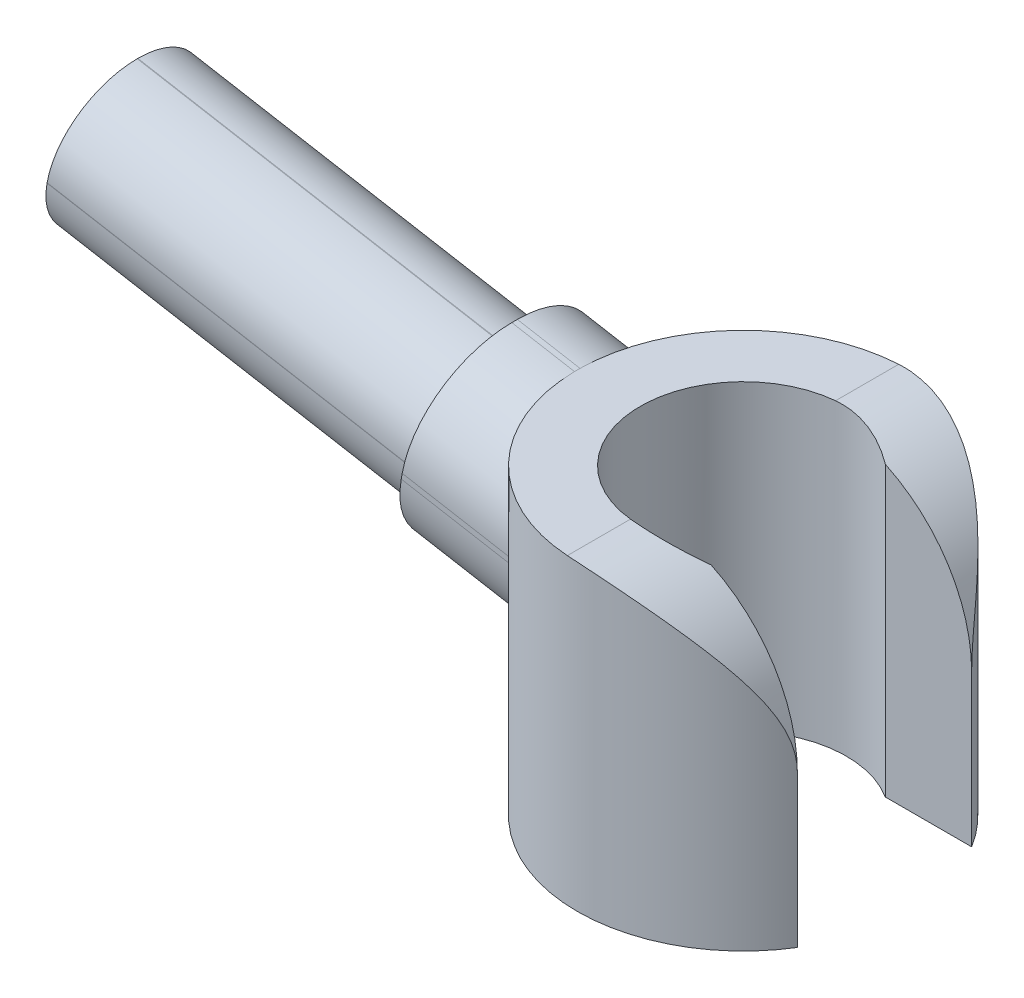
ISO-10303-21;
HEADER;
FILE_DESCRIPTION(('STEP AP214'),'2;1');
FILE_NAME('part.step','',(''),(''),'','','');
FILE_SCHEMA(('AUTOMOTIVE_DESIGN { 1 0 10303 214 1 1 1 1 }'));
ENDSEC;
DATA;
#1=APPLICATION_CONTEXT('core data for automotive mechanical design processes');
#2=APPLICATION_PROTOCOL_DEFINITION('international standard','automotive_design',2000,#1);
#3=PRODUCT_CONTEXT('',#1,'mechanical');
#4=PRODUCT('Part','Part','',(#3));
#5=PRODUCT_RELATED_PRODUCT_CATEGORY('part','',(#4));
#6=PRODUCT_DEFINITION_FORMATION('','',#4);
#7=PRODUCT_DEFINITION_CONTEXT('part definition',#1,'design');
#8=PRODUCT_DEFINITION('design','',#6,#7);
#9=PRODUCT_DEFINITION_SHAPE('','',#8);
#10=(LENGTH_UNIT() NAMED_UNIT(*) SI_UNIT(.MILLI.,.METRE.));
#11=(NAMED_UNIT(*) PLANE_ANGLE_UNIT() SI_UNIT($,.RADIAN.));
#12=(NAMED_UNIT(*) SI_UNIT($,.STERADIAN.) SOLID_ANGLE_UNIT());
#13=UNCERTAINTY_MEASURE_WITH_UNIT(LENGTH_MEASURE(1.E-05),#10,'distance_accuracy_value','');
#14=(GEOMETRIC_REPRESENTATION_CONTEXT(3) GLOBAL_UNCERTAINTY_ASSIGNED_CONTEXT((#13)) GLOBAL_UNIT_ASSIGNED_CONTEXT((#10,
#11,#12)) REPRESENTATION_CONTEXT('',''));
#15=CARTESIAN_POINT('',(0.,0.,0.));
#16=DIRECTION('',(0.,0.,1.));
#17=DIRECTION('',(1.,0.,0.));
#18=AXIS2_PLACEMENT_3D('',#15,#16,#17);
#19=CARTESIAN_POINT('',(-6.55577603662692,1.80583322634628,-0.01));
#20=DIRECTION('',(0.984807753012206,-0.173648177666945,0.));
#21=DIRECTION('',(0.173648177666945,0.984807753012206,0.));
#22=AXIS2_PLACEMENT_3D('',#19,#20,#21);
#23=CYLINDRICAL_SURFACE('',#22,1.1);
#24=DIRECTION('',(0.984807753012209,-0.173648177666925,0.));
#25=VECTOR('',#24,1.);
#26=CARTESIAN_POINT('',(-4.1233945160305,0.259969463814,-0.00999999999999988));
#27=LINE('',#26,#25);
#28=CARTESIAN_POINT('',(-6.74678903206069,0.722544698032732,-0.00999999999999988));
#29=VERTEX_POINT('',#28);
#30=CARTESIAN_POINT('',(-1.50000000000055,-0.20260577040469,-0.00999999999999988));
#31=VERTEX_POINT('',#30);
#32=EDGE_CURVE('E208',#29,#31,#27,.T.);
#33=ORIENTED_EDGE('',*,*,#32,.F.);
#34=CARTESIAN_POINT('',(-6.55577603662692,1.80583322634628,-0.01));
#35=DIRECTION('',(0.984807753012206,-0.173648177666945,0.));
#36=DIRECTION('',(0.173648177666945,0.984807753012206,0.));
#37=AXIS2_PLACEMENT_3D('',#34,#35,#36);
#38=CIRCLE('',#37,1.1);
#39=CARTESIAN_POINT('',(-6.55577603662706,1.80583322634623,-1.11));
#40=VERTEX_POINT('',#39);
#41=EDGE_CURVE('E204',#40,#29,#38,.F.);
#42=ORIENTED_EDGE('',*,*,#41,.F.);
#43=DIRECTION('',(0.984807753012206,-0.173648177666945,0.));
#44=VECTOR('',#43,1.);
#45=CARTESIAN_POINT('',(-6.55577603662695,1.80583322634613,-1.11));
#46=LINE('',#45,#44);
#47=CARTESIAN_POINT('',(-1.16940035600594,0.856069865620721,-1.11));
#48=VERTEX_POINT('',#47);
#49=EDGE_CURVE('E202',#40,#48,#46,.T.);
#50=ORIENTED_EDGE('',*,*,#49,.T.);
#51=CARTESIAN_POINT('',(-1.16940035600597,0.856069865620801,-0.01));
#52=DIRECTION('',(0.984807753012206,-0.173648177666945,0.));
#53=DIRECTION('',(0.173648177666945,0.984807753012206,0.));
#54=AXIS2_PLACEMENT_3D('',#51,#52,#53);
#55=CIRCLE('',#54,1.1);
#56=CARTESIAN_POINT('',(-1.35561396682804,-0.2,-0.255032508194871));
#57=VERTEX_POINT('',#56);
#58=EDGE_CURVE('E190',#57,#48,#55,.T.);
#59=ORIENTED_EDGE('',*,*,#58,.F.);
#60=CARTESIAN_POINT('',(4.81986947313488,-0.2,-0.01));
#61=DIRECTION('',(0.,1.,0.));
#62=DIRECTION('',(1.,0.,0.));
#63=AXIS2_PLACEMENT_3D('',#60,#61,#62);
#64=ELLIPSE('',#63,6.33464753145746,1.1);
#65=CARTESIAN_POINT('',(-1.5,-0.2,-0.0850933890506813));
#66=VERTEX_POINT('',#65);
#67=EDGE_CURVE('E20',#66,#57,#64,.F.);
#68=ORIENTED_EDGE('',*,*,#67,.F.);
#69=CARTESIAN_POINT('',(-1.5,0.914363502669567,-0.01));
#70=DIRECTION('',(-1.,0.,0.));
#71=DIRECTION('',(0.,-1.,0.));
#72=AXIS2_PLACEMENT_3D('',#69,#70,#71);
#73=ELLIPSE('',#72,1.11696927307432,1.1);
#74=EDGE_CURVE('E176',#31,#66,#73,.F.);
#75=ORIENTED_EDGE('',*,*,#74,.F.);
#76=EDGE_LOOP('',(#33,#42,#50,#59,#68,#75));
#77=FACE_BOUND('',#76,.T.);
#78=ADVANCED_FACE('F16',(#77),#23,.T.);
#79=CARTESIAN_POINT('',(-6.851724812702,0.7410477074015,-0.0104));
#80=DIRECTION('',(-0.173648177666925,-0.984807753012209,0.));
#81=DIRECTION('',(0.984807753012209,-0.173648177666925,0.));
#82=AXIS2_PLACEMENT_3D('',#79,#80,#81);
#83=PLANE('',#82);
#84=DIRECTION('',(-0.984807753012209,0.173648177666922,0.));
#85=VECTOR('',#84,1.);
#86=CARTESIAN_POINT('',(-4.05360119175,0.2476630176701,0.01));
#87=LINE('',#86,#85);
#88=CARTESIAN_POINT('',(-1.50000000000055,-0.202605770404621,0.01));
#89=VERTEX_POINT('',#88);
#90=CARTESIAN_POINT('',(-6.7467890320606,0.722544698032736,0.01));
#91=VERTEX_POINT('',#90);
#92=EDGE_CURVE('E219',#89,#91,#87,.T.);
#93=ORIENTED_EDGE('',*,*,#92,.T.);
#94=DIRECTION('',(0.,0.,-1.));
#95=VECTOR('',#94,1.);
#96=CARTESIAN_POINT('',(-6.74678903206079,0.72254469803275,0.));
#97=LINE('',#96,#95);
#98=EDGE_CURVE('E211',#91,#29,#97,.T.);
#99=ORIENTED_EDGE('',*,*,#98,.T.);
#100=ORIENTED_EDGE('',*,*,#32,.T.);
#101=DIRECTION('',(0.,0.,1.));
#102=VECTOR('',#101,1.);
#103=CARTESIAN_POINT('',(-1.5000000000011,-0.202605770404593,0.));
#104=LINE('',#103,#102);
#105=EDGE_CURVE('E526',#31,#89,#104,.T.);
#106=ORIENTED_EDGE('',*,*,#105,.T.);
#107=EDGE_LOOP('',(#93,#99,#100,#106));
#108=FACE_BOUND('',#107,.T.);
#109=ADVANCED_FACE('F295',(#108),#83,.T.);
#110=CARTESIAN_POINT('',(-6.663561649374,0.83674510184,-1.11));
#111=DIRECTION('',(0.,0.,1.));
#112=DIRECTION('',(1.,0.,0.));
#113=AXIS2_PLACEMENT_3D('',#110,#111,#112);
#114=PLANE('',#113);
#115=ORIENTED_EDGE('',*,*,#49,.F.);
#116=DIRECTION('',(-0.173648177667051,-0.984807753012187,0.));
#117=VECTOR('',#116,1.);
#118=CARTESIAN_POINT('',(-6.354159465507,2.949257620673,-1.11));
#119=LINE('',#118,#117);
#120=CARTESIAN_POINT('',(-6.55287107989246,1.82230805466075,-1.11000000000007));
#121=VERTEX_POINT('',#120);
#122=EDGE_CURVE('E209',#121,#40,#119,.T.);
#123=ORIENTED_EDGE('',*,*,#122,.F.);
#124=DIRECTION('',(0.984807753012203,-0.173648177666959,0.));
#125=VECTOR('',#124,1.);
#126=CARTESIAN_POINT('',(-3.85968323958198,1.34742637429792,-1.11000000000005));
#127=LINE('',#126,#125);
#128=CARTESIAN_POINT('',(-1.16649539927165,0.87254469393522,-1.10999999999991));
#129=VERTEX_POINT('',#128);
#130=EDGE_CURVE('E224',#121,#129,#127,.T.);
#131=ORIENTED_EDGE('',*,*,#130,.T.);
#132=DIRECTION('',(-0.173648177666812,-0.984807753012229,0.));
#133=VECTOR('',#132,1.);
#134=CARTESIAN_POINT('',(-0.8970313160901,2.400751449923,-1.11));
#135=LINE('',#134,#133);
#136=EDGE_CURVE('E213',#48,#129,#135,.F.);
#137=ORIENTED_EDGE('',*,*,#136,.F.);
#138=EDGE_LOOP('',(#115,#123,#131,#137));
#139=FACE_BOUND('',#138,.T.);
#140=ADVANCED_FACE('F298',(#139),#114,.F.);
#141=CARTESIAN_POINT('',(-1.16940035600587,0.85606986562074,0.01));
#142=DIRECTION('',(-0.984807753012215,0.17364817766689,0.));
#143=DIRECTION('',(-0.17364817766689,-0.984807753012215,0.));
#144=AXIS2_PLACEMENT_3D('',#141,#142,#143);
#145=CYLINDRICAL_SURFACE('',#144,1.0999999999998);
#146=DIRECTION('',(0.984807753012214,-0.173648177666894,0.));
#147=VECTOR('',#146,1.);
#148=CARTESIAN_POINT('',(-6.555776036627,1.805833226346,1.11));
#149=LINE('',#148,#147);
#150=CARTESIAN_POINT('',(-6.55577603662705,1.80583322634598,1.11));
#151=VERTEX_POINT('',#150);
#152=CARTESIAN_POINT('',(-1.16940035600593,0.85606986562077,1.11));
#153=VERTEX_POINT('',#152);
#154=EDGE_CURVE('E227',#151,#153,#149,.T.);
#155=ORIENTED_EDGE('',*,*,#154,.F.);
#156=CARTESIAN_POINT('',(-6.55577603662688,1.80583322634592,0.00999999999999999));
#157=DIRECTION('',(-0.984807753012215,0.17364817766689,0.));
#158=DIRECTION('',(-0.17364817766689,-0.984807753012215,0.));
#159=AXIS2_PLACEMENT_3D('',#156,#157,#158);
#160=CIRCLE('',#159,1.0999999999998);
#161=EDGE_CURVE('E220',#91,#151,#160,.T.);
#162=ORIENTED_EDGE('',*,*,#161,.F.);
#163=ORIENTED_EDGE('',*,*,#92,.F.);
#164=CARTESIAN_POINT('',(-1.5,0.914363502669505,0.01));
#165=DIRECTION('',(-1.,0.,0.));
#166=DIRECTION('',(0.,1.,0.));
#167=AXIS2_PLACEMENT_3D('',#164,#165,#166);
#168=ELLIPSE('',#167,1.11696927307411,1.0999999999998);
#169=CARTESIAN_POINT('',(-1.5,-0.2,0.0850933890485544));
#170=VERTEX_POINT('',#169);
#171=EDGE_CURVE('E217',#170,#89,#168,.F.);
#172=ORIENTED_EDGE('',*,*,#171,.F.);
#173=CARTESIAN_POINT('',(4.81986947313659,-0.2,0.01));
#174=DIRECTION('',(0.,1.,0.));
#175=DIRECTION('',(-1.,0.,0.));
#176=AXIS2_PLACEMENT_3D('',#173,#174,#175);
#177=ELLIPSE('',#176,6.33464753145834,1.0999999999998);
#178=CARTESIAN_POINT('',(-1.35561396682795,-0.2,0.255032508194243));
#179=VERTEX_POINT('',#178);
#180=EDGE_CURVE('E215',#179,#170,#177,.F.);
#181=ORIENTED_EDGE('',*,*,#180,.F.);
#182=CARTESIAN_POINT('',(-1.16940035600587,0.85606986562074,0.01));
#183=DIRECTION('',(-0.984807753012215,0.17364817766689,0.));
#184=DIRECTION('',(-0.17364817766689,-0.984807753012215,0.));
#185=AXIS2_PLACEMENT_3D('',#182,#183,#184);
#186=CIRCLE('',#185,1.0999999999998);
#187=EDGE_CURVE('E222',#153,#179,#186,.F.);
#188=ORIENTED_EDGE('',*,*,#187,.F.);
#189=EDGE_LOOP('',(#155,#162,#163,#172,#181,#188));
#190=FACE_BOUND('',#189,.T.);
#191=ADVANCED_FACE('F302',(#190),#145,.T.);
#192=CARTESIAN_POINT('',(-1.16649539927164,0.872544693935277,-0.01));
#193=DIRECTION('',(-0.984807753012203,0.173648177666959,0.));
#194=DIRECTION('',(-0.173648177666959,-0.984807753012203,0.));
#195=AXIS2_PLACEMENT_3D('',#192,#193,#194);
#196=CYLINDRICAL_SURFACE('',#195,1.10000000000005);
#197=DIRECTION('',(-0.984807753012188,0.173648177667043,0.));
#198=VECTOR('',#197,1.);
#199=CARTESIAN_POINT('',(-3.6686702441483,2.4307149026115,-0.0099999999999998));
#200=LINE('',#199,#198);
#201=CARTESIAN_POINT('',(-0.975482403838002,1.95583322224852,-0.0099999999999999));
#202=VERTEX_POINT('',#201);
#203=CARTESIAN_POINT('',(-6.36185808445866,2.90559658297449,-0.01));
#204=VERTEX_POINT('',#203);
#205=EDGE_CURVE('E563',#202,#204,#200,.T.);
#206=ORIENTED_EDGE('',*,*,#205,.F.);
#207=CARTESIAN_POINT('',(-1.16649539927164,0.872544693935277,-0.01));
#208=DIRECTION('',(-0.984807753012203,0.173648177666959,0.));
#209=DIRECTION('',(-0.173648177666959,-0.984807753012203,0.));
#210=AXIS2_PLACEMENT_3D('',#207,#208,#209);
#211=CIRCLE('',#210,1.10000000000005);
#212=EDGE_CURVE('E225',#129,#202,#211,.F.);
#213=ORIENTED_EDGE('',*,*,#212,.F.);
#214=ORIENTED_EDGE('',*,*,#130,.F.);
#215=CARTESIAN_POINT('',(-6.55287107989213,1.82230805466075,-0.0100000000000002));
#216=DIRECTION('',(-0.984807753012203,0.173648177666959,0.));
#217=DIRECTION('',(-0.173648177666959,-0.984807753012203,0.));
#218=AXIS2_PLACEMENT_3D('',#215,#216,#217);
#219=CIRCLE('',#218,1.10000000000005);
#220=EDGE_CURVE('E233',#204,#121,#219,.T.);
#221=ORIENTED_EDGE('',*,*,#220,.F.);
#222=EDGE_LOOP('',(#206,#213,#214,#221));
#223=FACE_BOUND('',#222,.T.);
#224=ADVANCED_FACE('F308',(#223),#196,.T.);
#225=CARTESIAN_POINT('',(-6.663526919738,0.8369420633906,1.11));
#226=DIRECTION('',(0.,0.,1.));
#227=DIRECTION('',(1.,0.,0.));
#228=AXIS2_PLACEMENT_3D('',#225,#226,#227);
#229=PLANE('',#228);
#230=ORIENTED_EDGE('',*,*,#154,.T.);
#231=DIRECTION('',(0.173648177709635,0.984807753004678,0.));
#232=VECTOR('',#231,1.);
#233=CARTESIAN_POINT('',(-1.169400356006,0.8560698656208,1.11));
#234=LINE('',#233,#232);
#235=CARTESIAN_POINT('',(-1.16823188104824,0.862696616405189,1.10999999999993));
#236=VERTEX_POINT('',#235);
#237=EDGE_CURVE('E230',#153,#236,#234,.T.);
#238=ORIENTED_EDGE('',*,*,#237,.T.);
#239=DIRECTION('',(-0.984807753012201,0.17364817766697,0.));
#240=VECTOR('',#239,1.);
#241=CARTESIAN_POINT('',(-3.86141972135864,1.33757829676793,1.10999999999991));
#242=LINE('',#241,#240);
#243=CARTESIAN_POINT('',(-6.55460756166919,1.81245997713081,1.11000000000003));
#244=VERTEX_POINT('',#243);
#245=EDGE_CURVE('E240',#236,#244,#242,.T.);
#246=ORIENTED_EDGE('',*,*,#245,.T.);
#247=DIRECTION('',(0.173648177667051,0.984807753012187,0.));
#248=VECTOR('',#247,1.);
#249=CARTESIAN_POINT('',(-6.55432355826,1.81407064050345,1.11));
#250=LINE('',#249,#248);
#251=EDGE_CURVE('E232',#151,#244,#250,.T.);
#252=ORIENTED_EDGE('',*,*,#251,.F.);
#253=EDGE_LOOP('',(#230,#238,#246,#252));
#254=FACE_BOUND('',#253,.T.);
#255=ADVANCED_FACE('F304',(#254),#229,.T.);
#256=CARTESIAN_POINT('',(-6.354159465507,2.949257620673,-1.1544));
#257=DIRECTION('',(-0.984807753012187,0.173648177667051,0.));
#258=DIRECTION('',(-0.173648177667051,-0.984807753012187,0.));
#259=AXIS2_PLACEMENT_3D('',#256,#257,#258);
#260=PLANE('',#259);
#261=DIRECTION('',(0.,0.,1.));
#262=VECTOR('',#261,1.);
#263=CARTESIAN_POINT('',(-6.36185808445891,2.90559658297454,-0.00499999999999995));
#264=LINE('',#263,#262);
#265=CARTESIAN_POINT('',(-6.36185808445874,2.90559658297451,0.));
#266=VERTEX_POINT('',#265);
#267=EDGE_CURVE('E561',#204,#266,#264,.T.);
#268=ORIENTED_EDGE('',*,*,#267,.F.);
#269=ORIENTED_EDGE('',*,*,#220,.T.);
#270=ORIENTED_EDGE('',*,*,#122,.T.);
#271=ORIENTED_EDGE('',*,*,#41,.T.);
#272=ORIENTED_EDGE('',*,*,#98,.F.);
#273=ORIENTED_EDGE('',*,*,#161,.T.);
#274=ORIENTED_EDGE('',*,*,#251,.T.);
#275=CARTESIAN_POINT('',(-6.55460756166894,1.81245997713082,0.));
#276=DIRECTION('',(0.984807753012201,-0.17364817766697,0.));
#277=DIRECTION('',(0.17364817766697,0.984807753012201,0.));
#278=AXIS2_PLACEMENT_3D('',#275,#276,#277);
#279=CIRCLE('',#278,1.10999999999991);
#280=EDGE_CURVE('E237',#244,#266,#279,.F.);
#281=ORIENTED_EDGE('',*,*,#280,.T.);
#282=EDGE_LOOP('',(#268,#269,#270,#271,#272,#273,#274,#281));
#283=FACE_BOUND('',#282,.T.);
#284=ADVANCED_FACE('F307',(#283),#260,.T.);
#285=CARTESIAN_POINT('',(-0.8677548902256,1.936837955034,-0.0102));
#286=DIRECTION('',(0.173648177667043,0.984807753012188,0.));
#287=DIRECTION('',(-0.984807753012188,0.173648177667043,0.));
#288=AXIS2_PLACEMENT_3D('',#285,#286,#287);
#289=PLANE('',#288);
#290=ORIENTED_EDGE('',*,*,#205,.T.);
#291=ORIENTED_EDGE('',*,*,#267,.T.);
#292=DIRECTION('',(0.984807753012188,-0.173648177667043,0.));
#293=VECTOR('',#292,1.);
#294=CARTESIAN_POINT('',(-3.6686702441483,2.4307149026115,0.));
#295=LINE('',#294,#293);
#296=CARTESIAN_POINT('',(-0.975482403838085,1.95583322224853,0.));
#297=VERTEX_POINT('',#296);
#298=EDGE_CURVE('E239',#266,#297,#295,.T.);
#299=ORIENTED_EDGE('',*,*,#298,.T.);
#300=DIRECTION('',(0.,0.,-1.));
#301=VECTOR('',#300,1.);
#302=CARTESIAN_POINT('',(-0.975482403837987,1.95583322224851,-0.00499999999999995));
#303=LINE('',#302,#301);
#304=EDGE_CURVE('E236',#297,#202,#303,.T.);
#305=ORIENTED_EDGE('',*,*,#304,.T.);
#306=EDGE_LOOP('',(#290,#291,#299,#305));
#307=FACE_BOUND('',#306,.T.);
#308=ADVANCED_FACE('F312',(#307),#289,.T.);
#309=CARTESIAN_POINT('',(-6.55460756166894,1.81245997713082,0.));
#310=DIRECTION('',(0.984807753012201,-0.17364817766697,0.));
#311=DIRECTION('',(0.17364817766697,0.984807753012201,0.));
#312=AXIS2_PLACEMENT_3D('',#309,#310,#311);
#313=CYLINDRICAL_SURFACE('',#312,1.10999999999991);
#314=ORIENTED_EDGE('',*,*,#298,.F.);
#315=ORIENTED_EDGE('',*,*,#280,.F.);
#316=ORIENTED_EDGE('',*,*,#245,.F.);
#317=CARTESIAN_POINT('',(-1.16823188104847,0.862696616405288,0.));
#318=DIRECTION('',(0.984807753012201,-0.17364817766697,0.));
#319=DIRECTION('',(0.17364817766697,0.984807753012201,0.));
#320=AXIS2_PLACEMENT_3D('',#317,#318,#319);
#321=CIRCLE('',#320,1.10999999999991);
#322=EDGE_CURVE('E241',#297,#236,#321,.T.);
#323=ORIENTED_EDGE('',*,*,#322,.F.);
#324=EDGE_LOOP('',(#314,#315,#316,#323));
#325=FACE_BOUND('',#324,.T.);
#326=ADVANCED_FACE('F316',(#325),#313,.T.);
#327=CARTESIAN_POINT('',(-1.5,-0.2026578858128,-0.1009324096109));
#328=DIRECTION('',(-1.,0.,0.));
#329=DIRECTION('',(0.,0.,1.));
#330=AXIS2_PLACEMENT_3D('',#327,#328,#329);
#331=PLANE('',#330);
#332=DIRECTION('',(0.,0.,1.));
#333=VECTOR('',#332,1.);
#334=CARTESIAN_POINT('',(-1.5,-0.2,0.));
#335=LINE('',#334,#333);
#336=EDGE_CURVE('E187',#66,#170,#335,.T.);
#337=ORIENTED_EDGE('',*,*,#336,.T.);
#338=ORIENTED_EDGE('',*,*,#171,.T.);
#339=ORIENTED_EDGE('',*,*,#105,.F.);
#340=ORIENTED_EDGE('',*,*,#74,.T.);
#341=EDGE_LOOP('',(#337,#338,#339,#340));
#342=FACE_BOUND('',#341,.T.);
#343=ADVANCED_FACE('F318',(#342),#331,.F.);
#344=CARTESIAN_POINT('',(-1.18629678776,0.6439002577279,1.39));
#345=DIRECTION('',(0.,0.,1.));
#346=DIRECTION('',(1.,0.,0.));
#347=AXIS2_PLACEMENT_3D('',#344,#345,#346);
#348=PLANE('',#347);
#349=DIRECTION('',(0.984807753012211,-0.173648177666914,0.));
#350=VECTOR('',#349,1.);
#351=CARTESIAN_POINT('',(-0.34097287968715,0.7980626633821,1.39));
#352=LINE('',#351,#350);
#353=CARTESIAN_POINT('',(-1.15434002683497,0.941481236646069,1.39));
#354=VERTEX_POINT('',#353);
#355=CARTESIAN_POINT('',(0.4434980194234,0.659739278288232,1.39));
#356=VERTEX_POINT('',#355);
#357=EDGE_CURVE('E260',#354,#356,#352,.T.);
#358=ORIENTED_EDGE('',*,*,#357,.T.);
#359=DIRECTION('',(0.,1.,0.));
#360=VECTOR('',#359,1.);
#361=CARTESIAN_POINT('',(0.4434980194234,0.84000256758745,1.39));
#362=LINE('',#361,#360);
#363=CARTESIAN_POINT('',(0.44349801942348,0.74097340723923,1.39000000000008));
#364=VERTEX_POINT('',#363);
#365=EDGE_CURVE('E245',#356,#364,#362,.T.);
#366=ORIENTED_EDGE('',*,*,#365,.T.);
#367=DIRECTION('',(-0.984807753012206,0.173648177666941,0.));
#368=VECTOR('',#367,1.);
#369=CARTESIAN_POINT('',(-0.348475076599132,0.880619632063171,1.39000000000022));
#370=LINE('',#369,#368);
#371=CARTESIAN_POINT('',(-1.14044817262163,1.02026585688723,1.39000000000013));
#372=VERTEX_POINT('',#371);
#373=EDGE_CURVE('E265',#364,#372,#370,.T.);
#374=ORIENTED_EDGE('',*,*,#373,.T.);
#375=DIRECTION('',(0.173648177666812,0.984807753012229,0.));
#376=VECTOR('',#375,1.);
#377=CARTESIAN_POINT('',(-1.13081854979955,1.07487816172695,1.39));
#378=LINE('',#377,#376);
#379=EDGE_CURVE('E244',#354,#372,#378,.T.);
#380=ORIENTED_EDGE('',*,*,#379,.F.);
#381=EDGE_LOOP('',(#358,#366,#374,#380));
#382=FACE_BOUND('',#381,.T.);
#383=ADVANCED_FACE('F321',(#382),#348,.T.);
#384=CARTESIAN_POINT('',(-0.8970313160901,2.400751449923,-1.4456));
#385=DIRECTION('',(-0.984807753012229,0.173648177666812,0.));
#386=DIRECTION('',(-0.173648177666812,-0.984807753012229,0.));
#387=AXIS2_PLACEMENT_3D('',#384,#385,#386);
#388=PLANE('',#387);
#389=DIRECTION('',(-0.173648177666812,-0.984807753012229,0.));
#390=VECTOR('',#389,1.);
#391=CARTESIAN_POINT('',(-0.8970313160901,2.400751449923,-1.39));
#392=LINE('',#391,#390);
#393=CARTESIAN_POINT('',(-1.14044817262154,1.02026585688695,-1.39000000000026));
#394=VERTEX_POINT('',#393);
#395=CARTESIAN_POINT('',(-1.15434002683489,0.941481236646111,-1.39));
#396=VERTEX_POINT('',#395);
#397=EDGE_CURVE('E246',#394,#396,#392,.T.);
#398=ORIENTED_EDGE('',*,*,#397,.T.);
#399=CARTESIAN_POINT('',(-1.15434002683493,0.941481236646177,-0.04));
#400=DIRECTION('',(-0.984807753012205,0.17364817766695,0.));
#401=DIRECTION('',(-0.17364817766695,-0.984807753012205,0.));
#402=AXIS2_PLACEMENT_3D('',#399,#400,#401);
#403=CIRCLE('',#402,1.35);
#404=CARTESIAN_POINT('',(-1.35561396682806,-0.2,-0.732105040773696));
#405=VERTEX_POINT('',#404);
#406=EDGE_CURVE('E195',#396,#405,#403,.T.);
#407=ORIENTED_EDGE('',*,*,#406,.T.);
#408=DIRECTION('',(0.,0.,1.));
#409=VECTOR('',#408,1.);
#410=CARTESIAN_POINT('',(-1.35561396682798,-0.2,0.));
#411=LINE('',#410,#409);
#412=EDGE_CURVE('E186',#405,#57,#411,.T.);
#413=ORIENTED_EDGE('',*,*,#412,.T.);
#414=ORIENTED_EDGE('',*,*,#58,.T.);
#415=ORIENTED_EDGE('',*,*,#136,.T.);
#416=ORIENTED_EDGE('',*,*,#212,.T.);
#417=ORIENTED_EDGE('',*,*,#304,.F.);
#418=ORIENTED_EDGE('',*,*,#322,.T.);
#419=ORIENTED_EDGE('',*,*,#237,.F.);
#420=ORIENTED_EDGE('',*,*,#187,.T.);
#421=DIRECTION('',(0.,0.,1.));
#422=VECTOR('',#421,1.);
#423=CARTESIAN_POINT('',(-1.35561396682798,-0.2,0.));
#424=LINE('',#423,#422);
#425=CARTESIAN_POINT('',(-1.35561396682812,-0.2,0.732105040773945));
#426=VERTEX_POINT('',#425);
#427=EDGE_CURVE('E257',#179,#426,#424,.T.);
#428=ORIENTED_EDGE('',*,*,#427,.T.);
#429=CARTESIAN_POINT('',(-1.1543400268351,0.941481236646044,0.04));
#430=DIRECTION('',(0.984807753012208,-0.173648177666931,0.));
#431=DIRECTION('',(0.173648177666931,0.984807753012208,0.));
#432=AXIS2_PLACEMENT_3D('',#429,#430,#431);
#433=CIRCLE('',#432,1.35);
#434=EDGE_CURVE('E256',#426,#354,#433,.F.);
#435=ORIENTED_EDGE('',*,*,#434,.T.);
#436=ORIENTED_EDGE('',*,*,#379,.T.);
#437=CARTESIAN_POINT('',(-1.14044817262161,1.0202658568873,0.04));
#438=DIRECTION('',(0.984807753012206,-0.173648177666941,0.));
#439=DIRECTION('',(0.173648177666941,0.984807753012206,0.));
#440=AXIS2_PLACEMENT_3D('',#437,#438,#439);
#441=CIRCLE('',#440,1.35000000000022);
#442=CARTESIAN_POINT('',(-0.906023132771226,2.34975632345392,0.04));
#443=VERTEX_POINT('',#442);
#444=EDGE_CURVE('E261',#372,#443,#441,.F.);
#445=ORIENTED_EDGE('',*,*,#444,.T.);
#446=DIRECTION('',(0.,0.,-1.));
#447=VECTOR('',#446,1.);
#448=CARTESIAN_POINT('',(-0.906023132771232,2.34975632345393,0.));
#449=LINE('',#448,#447);
#450=CARTESIAN_POINT('',(-0.906023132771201,2.34975632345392,-0.0399999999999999));
#451=VERTEX_POINT('',#450);
#452=EDGE_CURVE('E249',#443,#451,#449,.T.);
#453=ORIENTED_EDGE('',*,*,#452,.T.);
#454=CARTESIAN_POINT('',(-1.14044817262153,1.02026585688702,-0.04));
#455=DIRECTION('',(-0.984807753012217,0.173648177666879,0.));
#456=DIRECTION('',(-0.173648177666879,-0.984807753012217,0.));
#457=AXIS2_PLACEMENT_3D('',#454,#455,#456);
#458=CIRCLE('',#457,1.35000000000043);
#459=EDGE_CURVE('E280',#451,#394,#458,.T.);
#460=ORIENTED_EDGE('',*,*,#459,.T.);
#461=EDGE_LOOP('',(#398,#407,#413,#414,#415,#416,#417,#418,#419,#420,#428,#435,#436,#445,#453,#460));
#462=FACE_BOUND('',#461,.T.);
#463=ADVANCED_FACE('F192',(#462),#388,.T.);
#464=CARTESIAN_POINT('',(-1.18629678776,0.6439002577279,-1.39));
#465=DIRECTION('',(0.,0.,1.));
#466=DIRECTION('',(1.,0.,0.));
#467=AXIS2_PLACEMENT_3D('',#464,#465,#466);
#468=PLANE('',#467);
#469=DIRECTION('',(-0.984807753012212,0.173648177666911,0.));
#470=VECTOR('',#469,1.);
#471=CARTESIAN_POINT('',(-0.34097289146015,0.79806266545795,-1.39));
#472=LINE('',#471,#470);
#473=CARTESIAN_POINT('',(0.44349801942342,0.659739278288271,-1.39));
#474=VERTEX_POINT('',#473);
#475=EDGE_CURVE('E251',#474,#396,#472,.T.);
#476=ORIENTED_EDGE('',*,*,#475,.T.);
#477=ORIENTED_EDGE('',*,*,#397,.F.);
#478=DIRECTION('',(0.984807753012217,-0.17364817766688,1.20300086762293E-13));
#479=VECTOR('',#478,1.);
#480=CARTESIAN_POINT('',(-0.348475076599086,0.88061963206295,-1.39000000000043));
#481=LINE('',#480,#479);
#482=CARTESIAN_POINT('',(0.443498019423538,0.740973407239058,-1.39000000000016));
#483=VERTEX_POINT('',#482);
#484=EDGE_CURVE('E370',#394,#483,#481,.T.);
#485=ORIENTED_EDGE('',*,*,#484,.T.);
#486=DIRECTION('',(0.,1.,0.));
#487=VECTOR('',#486,1.);
#488=CARTESIAN_POINT('',(0.4434980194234,0.84000256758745,-1.39));
#489=LINE('',#488,#487);
#490=EDGE_CURVE('E248',#474,#483,#489,.T.);
#491=ORIENTED_EDGE('',*,*,#490,.F.);
#492=EDGE_LOOP('',(#476,#477,#485,#491));
#493=FACE_BOUND('',#492,.T.);
#494=ADVANCED_FACE('F327',(#493),#468,.F.);
#495=CARTESIAN_POINT('',(0.484279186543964,0.652548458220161,-0.04));
#496=DIRECTION('',(-0.984807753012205,0.17364817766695,0.));
#497=DIRECTION('',(-0.17364817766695,-0.984807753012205,0.));
#498=AXIS2_PLACEMENT_3D('',#495,#496,#497);
#499=CYLINDRICAL_SURFACE('',#498,1.35);
#500=ORIENTED_EDGE('',*,*,#475,.F.);
#501=CARTESIAN_POINT('',(0.443498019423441,0.659739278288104,-1.39));
#502=CARTESIAN_POINT('',(0.443505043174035,0.626928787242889,-1.39000219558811));
#503=CARTESIAN_POINT('',(0.442672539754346,0.594131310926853,-1.38883873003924));
#504=CARTESIAN_POINT('',(0.439353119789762,0.52879840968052,-1.38415190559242));
#505=CARTESIAN_POINT('',(0.436866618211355,0.4962629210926,-1.38062913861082));
#506=CARTESIAN_POINT('',(0.427005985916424,0.399804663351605,-1.36654042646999));
#507=CARTESIAN_POINT('',(0.417230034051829,0.336591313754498,-1.35245465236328));
#508=CARTESIAN_POINT('',(0.392367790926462,0.214100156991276,-1.31525794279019));
#509=CARTESIAN_POINT('',(0.377283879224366,0.154820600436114,-1.29215105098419));
#510=CARTESIAN_POINT('',(0.343470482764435,0.0412899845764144,-1.23762265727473));
#511=CARTESIAN_POINT('',(0.324738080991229,-0.0129569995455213,-1.20619449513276));
#512=CARTESIAN_POINT('',(0.295920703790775,-0.0882140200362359,-1.15464512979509));
#513=CARTESIAN_POINT('',(0.286542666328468,-0.11154065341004,-1.13741462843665));
#514=CARTESIAN_POINT('',(0.267584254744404,-0.156799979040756,-1.10146049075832));
#515=CARTESIAN_POINT('',(0.258004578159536,-0.178736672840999,-1.0827415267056));
#516=CARTESIAN_POINT('',(0.248391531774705,-0.199999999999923,-1.06328782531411));
#517=B_SPLINE_CURVE_WITH_KNOTS('',3,(#501,#502,#503,#504,#505,#506,#507,#508,#509,#510,#511,
#512,#513,#514,#515,#516),.UNSPECIFIED.,.F.,.F.,(4,2,2,2,2,2,2,4),(0.,0.0983723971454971,
0.196720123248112,0.392117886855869,0.587428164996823,0.782895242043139,0.874276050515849,
0.965380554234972),.UNSPECIFIED.);
#518=CARTESIAN_POINT('',(0.248391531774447,-0.200000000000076,-1.06328782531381));
#519=VERTEX_POINT('',#518);
#520=EDGE_CURVE('E423',#474,#519,#517,.T.);
#521=ORIENTED_EDGE('',*,*,#520,.T.);
#522=CARTESIAN_POINT('',(5.31932175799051,-0.2,-0.0400000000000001));
#523=DIRECTION('',(0.,1.,0.));
#524=DIRECTION('',(-1.,0.,0.));
#525=AXIS2_PLACEMENT_3D('',#522,#523,#524);
#526=ELLIPSE('',#525,7.77434015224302,1.35);
#527=EDGE_CURVE('E197',#519,#405,#526,.T.);
#528=ORIENTED_EDGE('',*,*,#527,.T.);
#529=ORIENTED_EDGE('',*,*,#406,.F.);
#530=EDGE_LOOP('',(#500,#521,#528,#529));
#531=FACE_BOUND('',#530,.T.);
#532=ADVANCED_FACE('F330',(#531),#499,.T.);
#533=CARTESIAN_POINT('',(0.2833593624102,-0.2,1.105819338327));
#534=DIRECTION('',(0.,1.,0.));
#535=DIRECTION('',(0.,0.,-1.));
#536=AXIS2_PLACEMENT_3D('',#533,#534,#535);
#537=PLANE('',#536);
#538=ORIENTED_EDGE('',*,*,#427,.F.);
#539=ORIENTED_EDGE('',*,*,#180,.T.);
#540=ORIENTED_EDGE('',*,*,#336,.F.);
#541=ORIENTED_EDGE('',*,*,#67,.T.);
#542=ORIENTED_EDGE('',*,*,#412,.F.);
#543=ORIENTED_EDGE('',*,*,#527,.F.);
#544=CARTESIAN_POINT('',(2.4,-0.20000000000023,0.));
#545=DIRECTION('',(0.,1.,0.));
#546=DIRECTION('',(0.,0.,1.));
#547=AXIS2_PLACEMENT_3D('',#544,#545,#546);
#548=CIRCLE('',#547,2.4);
#549=CARTESIAN_POINT('',(0.248391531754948,-0.200000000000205,1.06328782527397));
#550=VERTEX_POINT('',#549);
#551=EDGE_CURVE('E485',#519,#550,#548,.T.);
#552=ORIENTED_EDGE('',*,*,#551,.T.);
#553=CARTESIAN_POINT('',(5.31932175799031,-0.2,0.0400000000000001));
#554=DIRECTION('',(0.,1.,0.));
#555=DIRECTION('',(1.,0.,0.));
#556=AXIS2_PLACEMENT_3D('',#553,#554,#555);
#557=ELLIPSE('',#556,7.77434015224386,1.35);
#558=EDGE_CURVE('E253',#550,#426,#557,.F.);
#559=ORIENTED_EDGE('',*,*,#558,.T.);
#560=EDGE_LOOP('',(#538,#539,#540,#541,#542,#543,#552,#559));
#561=FACE_BOUND('',#560,.T.);
#562=ADVANCED_FACE('F184',(#561),#537,.F.);
#563=CARTESIAN_POINT('',(-1.1543400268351,0.941481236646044,0.04));
#564=DIRECTION('',(0.984807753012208,-0.173648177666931,0.));
#565=DIRECTION('',(0.173648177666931,0.984807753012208,0.));
#566=AXIS2_PLACEMENT_3D('',#563,#564,#565);
#567=CYLINDRICAL_SURFACE('',#566,1.35);
#568=ORIENTED_EDGE('',*,*,#357,.F.);
#569=ORIENTED_EDGE('',*,*,#434,.F.);
#570=ORIENTED_EDGE('',*,*,#558,.F.);
#571=CARTESIAN_POINT('',(0.248391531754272,-0.200000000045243,1.06328782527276));
#572=CARTESIAN_POINT('',(0.270460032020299,-0.151209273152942,1.10798904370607));
#573=CARTESIAN_POINT('',(0.292414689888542,-0.098678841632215,1.14885543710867));
#574=CARTESIAN_POINT('',(0.334037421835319,0.0132611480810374,1.22211437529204));
#575=CARTESIAN_POINT('',(0.353691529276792,0.0727087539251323,1.25445651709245));
#576=CARTESIAN_POINT('',(0.388432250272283,0.197599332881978,1.30945470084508));
#577=CARTESIAN_POINT('',(0.403496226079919,0.26307001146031,1.33206295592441));
#578=CARTESIAN_POINT('',(0.426833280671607,0.397729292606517,1.3664025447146));
#579=CARTESIAN_POINT('',(0.435136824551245,0.466899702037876,1.37818270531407));
#580=CARTESIAN_POINT('',(0.440899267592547,0.557120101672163,1.38633508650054));
#581=CARTESIAN_POINT('',(0.441874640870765,0.577606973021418,1.38771218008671));
#582=CARTESIAN_POINT('',(0.443173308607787,0.618639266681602,1.38954373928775));
#583=CARTESIAN_POINT('',(0.443496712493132,0.639184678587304,1.38999835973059));
#584=CARTESIAN_POINT('',(0.443498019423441,0.659739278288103,1.39));
#585=B_SPLINE_CURVE_WITH_KNOTS('',3,(#571,#572,#573,#574,#575,#576,#577,#578,#579,#580,#581,
#582,#583,#584),.UNSPECIFIED.,.F.,.F.,(4,2,2,2,2,2,4),(0.,0.209264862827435,0.419740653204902,
0.631238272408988,0.841777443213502,0.903425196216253,0.965062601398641),.UNSPECIFIED.);
#586=EDGE_CURVE('E474',#550,#356,#585,.T.);
#587=ORIENTED_EDGE('',*,*,#586,.T.);
#588=EDGE_LOOP('',(#568,#569,#570,#587));
#589=FACE_BOUND('',#588,.T.);
#590=ADVANCED_FACE('F334',(#589),#567,.T.);
#591=CARTESIAN_POINT('',(-1.14044817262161,1.0202658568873,0.04));
#592=DIRECTION('',(0.984807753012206,-0.173648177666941,0.));
#593=DIRECTION('',(0.173648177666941,0.984807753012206,0.));
#594=AXIS2_PLACEMENT_3D('',#591,#592,#593);
#595=CYLINDRICAL_SURFACE('',#594,1.35000000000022);
#596=DIRECTION('',(-0.98480775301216,0.173648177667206,0.));
#597=VECTOR('',#596,1.);
#598=CARTESIAN_POINT('',(0.01812046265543,2.186804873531,0.04));
#599=LINE('',#598,#597);
#600=CARTESIAN_POINT('',(0.000184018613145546,2.18998152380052,0.0399991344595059));
#601=VERTEX_POINT('',#600);
#602=EDGE_CURVE('E264',#443,#601,#599,.F.);
#603=ORIENTED_EDGE('',*,*,#602,.F.);
#604=ORIENTED_EDGE('',*,*,#444,.F.);
#605=ORIENTED_EDGE('',*,*,#373,.F.);
#606=CARTESIAN_POINT('',(0.443498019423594,0.74097340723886,1.39000000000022));
#607=CARTESIAN_POINT('',(0.443508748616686,0.778593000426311,1.39000315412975));
#608=CARTESIAN_POINT('',(0.442413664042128,0.816178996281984,1.38847461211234));
#609=CARTESIAN_POINT('',(0.438181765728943,0.890952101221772,1.38249413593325));
#610=CARTESIAN_POINT('',(0.435047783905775,0.928139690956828,1.37804625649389));
#611=CARTESIAN_POINT('',(0.422909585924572,1.03810542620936,1.36063091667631));
#612=CARTESIAN_POINT('',(0.411163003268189,1.10996870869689,1.34358644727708));
#613=CARTESIAN_POINT('',(0.382375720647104,1.24905569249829,1.29994682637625));
#614=CARTESIAN_POINT('',(0.36536288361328,1.31630158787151,1.27340182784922));
#615=CARTESIAN_POINT('',(0.327969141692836,1.44588513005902,1.21160886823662));
#616=CARTESIAN_POINT('',(0.307578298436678,1.50820746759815,1.17633507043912));
#617=CARTESIAN_POINT('',(0.261758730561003,1.63688033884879,1.09116268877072));
#618=CARTESIAN_POINT('',(0.236056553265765,1.70217314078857,1.03980682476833));
#619=CARTESIAN_POINT('',(0.185260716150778,1.82328989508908,0.926697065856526));
#620=CARTESIAN_POINT('',(0.160166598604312,1.87912117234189,0.864951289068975));
#621=CARTESIAN_POINT('',(0.117067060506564,1.97096000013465,0.74275612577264));
#622=CARTESIAN_POINT('',(0.0985768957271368,2.00872029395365,0.683800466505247));
#623=CARTESIAN_POINT('',(0.0653491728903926,2.07465247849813,0.559911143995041));
#624=CARTESIAN_POINT('',(0.0506018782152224,2.10284931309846,0.494993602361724));
#625=CARTESIAN_POINT('',(0.0272684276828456,2.14618725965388,0.366126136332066));
#626=CARTESIAN_POINT('',(0.0182648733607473,2.16223495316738,0.302563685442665));
#627=CARTESIAN_POINT('',(0.00857475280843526,2.17858113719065,0.205338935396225));
#628=CARTESIAN_POINT('',(0.00597785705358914,2.18274327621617,0.172476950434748));
#629=CARTESIAN_POINT('',(0.00213147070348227,2.18837773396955,0.106420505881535));
#630=CARTESIAN_POINT('',(0.000883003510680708,2.18984801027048,0.0732258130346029));
#631=CARTESIAN_POINT('',(0.000333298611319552,2.18994123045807,0.0399965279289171));
#632=B_SPLINE_CURVE_WITH_KNOTS('',3,(#606,#607,#608,#609,#610,#611,#612,#613,#614,#615,#616,
#617,#618,#619,#620,#621,#622,#623,#624,#625,#626,#627,#628,#629,#630,#631),.UNSPECIFIED.,.F.,
.F.,(4,2,2,2,2,2,2,2,2,2,2,2,4),(0.,0.112754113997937,0.225351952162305,0.448532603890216,
0.670552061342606,0.893236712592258,1.15300782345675,1.41257689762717,1.62895677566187,
1.84476786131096,2.04222018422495,2.14177542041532,2.24140616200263),.UNSPECIFIED.);
#633=EDGE_CURVE('E462',#364,#601,#632,.T.);
#634=ORIENTED_EDGE('',*,*,#633,.T.);
#635=EDGE_LOOP('',(#603,#604,#605,#634));
#636=FACE_BOUND('',#635,.T.);
#637=ADVANCED_FACE('F399',(#636),#595,.T.);
#638=CARTESIAN_POINT('',(2.252645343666,0.,1.25303800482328));
#639=DIRECTION('',(0.,0.,1.));
#640=DIRECTION('',(1.,0.,0.));
#641=AXIS2_PLACEMENT_3D('',#638,#639,#640);
#642=CYLINDRICAL_SURFACE('',#641,2.19);
#643=CARTESIAN_POINT('',(2.25264534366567,2.19,2.39547210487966));
#644=CARTESIAN_POINT('',(2.30246855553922,2.19001174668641,2.39854885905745));
#645=CARTESIAN_POINT('',(2.35238291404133,2.188300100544,2.40004738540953));
#646=CARTESIAN_POINT('',(2.45194700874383,2.18147970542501,2.39995066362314));
#647=CARTESIAN_POINT('',(2.50159688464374,2.1763729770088,2.39835725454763));
#648=CARTESIAN_POINT('',(2.59986875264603,2.1628637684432,2.39216657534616));
#649=CARTESIAN_POINT('',(2.64849569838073,2.15448674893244,2.38759233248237));
#650=CARTESIAN_POINT('',(2.74473028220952,2.13456570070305,2.37560858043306));
#651=CARTESIAN_POINT('',(2.79233782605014,2.12302138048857,2.36819881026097));
#652=CARTESIAN_POINT('',(2.93293261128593,2.0839220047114,2.34201383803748));
#653=CARTESIAN_POINT('',(3.02398568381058,2.05185899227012,2.31926276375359));
#654=CARTESIAN_POINT('',(3.19895744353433,1.97729355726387,2.26497468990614));
#655=CARTESIAN_POINT('',(3.28286170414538,1.93477066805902,2.23342044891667));
#656=CARTESIAN_POINT('',(3.47083847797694,1.82423570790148,2.15109770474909));
#657=CARTESIAN_POINT('',(3.57149955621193,1.75253358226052,2.0974845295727));
#658=CARTESIAN_POINT('',(3.75706138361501,1.59612962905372,1.98251298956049));
#659=CARTESIAN_POINT('',(3.84193263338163,1.5114039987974,1.92114048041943));
#660=CARTESIAN_POINT('',(3.99752222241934,1.32897545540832,1.79392561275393));
#661=CARTESIAN_POINT('',(4.06792312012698,1.23104664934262,1.72801835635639));
#662=CARTESIAN_POINT('',(4.16119551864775,1.07572004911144,1.63101782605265));
#663=CARTESIAN_POINT('',(4.19023871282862,1.0225208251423,1.59898455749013));
#664=CARTESIAN_POINT('',(4.2441215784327,0.913147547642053,1.5365258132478));
#665=CARTESIAN_POINT('',(4.26896331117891,0.85697497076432,1.50609955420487));
#666=CARTESIAN_POINT('',(4.31967602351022,0.727603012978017,1.44115117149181));
#667=CARTESIAN_POINT('',(4.34437140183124,0.653545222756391,1.40739062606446));
#668=CARTESIAN_POINT('',(4.38612824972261,0.500581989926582,1.3478176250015));
#669=CARTESIAN_POINT('',(4.40323338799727,0.421707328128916,1.32195997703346));
#670=CARTESIAN_POINT('',(4.42465337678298,0.285595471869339,1.28881878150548));
#671=CARTESIAN_POINT('',(4.43131207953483,0.229551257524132,1.27823658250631));
#672=CARTESIAN_POINT('',(4.44034788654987,0.115731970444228,1.26372806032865));
#673=CARTESIAN_POINT('',(4.44268257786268,0.0579453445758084,1.25986769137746));
#674=CARTESIAN_POINT('',(4.442645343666,-4.42022821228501E-08,1.25999999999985));
#675=B_SPLINE_CURVE_WITH_KNOTS('',3,(#643,#644,#645,#646,#647,#648,#649,#650,#651,#652,#653,
#654,#655,#656,#657,#658,#659,#660,#661,#662,#663,#664,#665,#666,#667,#668,#669,#670,#671,#672,
#673,#674),.UNSPECIFIED.,.F.,.F.,(4,2,2,2,2,2,2,2,2,2,2,2,2,2,2,4),(0.,0.149690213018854,
0.299291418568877,0.447750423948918,0.596223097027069,0.892288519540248,1.18893792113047,
1.59087625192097,1.9935581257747,2.40430361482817,2.60980613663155,2.8152075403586,
3.06974922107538,3.32280684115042,3.4945346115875,3.66793806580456),.UNSPECIFIED.);
#676=CARTESIAN_POINT('',(2.25264534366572,2.19,2.39547210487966));
#677=VERTEX_POINT('',#676);
#678=CARTESIAN_POINT('',(4.44264534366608,-2.210114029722E-08,1.26000000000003));
#679=VERTEX_POINT('',#678);
#680=EDGE_CURVE('E380',#677,#679,#675,.T.);
#681=ORIENTED_EDGE('',*,*,#680,.T.);
#682=CARTESIAN_POINT('',(2.252645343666,0.,1.26000000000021));
#683=DIRECTION('',(0.,0.,1.));
#684=DIRECTION('',(1.,0.,0.));
#685=AXIS2_PLACEMENT_3D('',#682,#683,#684);
#686=CIRCLE('',#685,2.19);
#687=CARTESIAN_POINT('',(3.19529868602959,1.9767409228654,1.26000000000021));
#688=VERTEX_POINT('',#687);
#689=EDGE_CURVE('E415',#688,#679,#686,.F.);
#690=ORIENTED_EDGE('',*,*,#689,.F.);
#691=CARTESIAN_POINT('',(2.25264534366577,2.19,1.48269572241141));
#692=CARTESIAN_POINT('',(2.25791073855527,2.1900000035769,1.48322067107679));
#693=CARTESIAN_POINT('',(2.26317896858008,2.18998101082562,1.48371716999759));
#694=CARTESIAN_POINT('',(2.27372008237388,2.18990493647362,1.48465335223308));
#695=CARTESIAN_POINT('',(2.27899296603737,2.18984785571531,1.48509303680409));
#696=CARTESIAN_POINT('',(2.28954251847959,2.18969551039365,1.48591569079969));
#697=CARTESIAN_POINT('',(2.2948191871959,2.18960024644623,1.486298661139));
#698=CARTESIAN_POINT('',(2.30537544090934,2.18937146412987,1.48700798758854));
#699=CARTESIAN_POINT('',(2.31065502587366,2.18923794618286,1.48733434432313));
#700=CARTESIAN_POINT('',(2.32121624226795,2.18893260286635,1.4879305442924));
#701=CARTESIAN_POINT('',(2.32649787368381,2.18876077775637,1.48820038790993));
#702=CARTESIAN_POINT('',(2.33706231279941,2.18837878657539,1.4886836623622));
#703=CARTESIAN_POINT('',(2.34234512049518,2.18816862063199,1.4888970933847));
#704=CARTESIAN_POINT('',(2.35291104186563,2.18770993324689,1.48926764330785));
#705=CARTESIAN_POINT('',(2.3581941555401,2.18746141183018,1.4894247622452));
#706=CARTESIAN_POINT('',(2.36875981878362,2.18692601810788,1.48968278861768));
#707=CARTESIAN_POINT('',(2.37404236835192,2.18663914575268,1.4897836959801));
#708=CARTESIAN_POINT('',(2.38460603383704,2.18602707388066,1.48992939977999));
#709=CARTESIAN_POINT('',(2.38988714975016,2.18570187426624,1.48997419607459));
#710=CARTESIAN_POINT('',(2.40044707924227,2.18501319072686,1.49000777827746));
#711=CARTESIAN_POINT('',(2.40572589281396,2.18464970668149,1.48999656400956));
#712=CARTESIAN_POINT('',(2.41628035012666,2.18388451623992,1.48991822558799));
#713=CARTESIAN_POINT('',(2.4215559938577,2.18348280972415,1.4898511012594));
#714=CARTESIAN_POINT('',(2.43210324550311,2.18264125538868,1.48966104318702));
#715=CARTESIAN_POINT('',(2.4373748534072,2.18220140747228,1.48953810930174));
#716=CARTESIAN_POINT('',(2.447913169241,2.18128367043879,1.48923653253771));
#717=CARTESIAN_POINT('',(2.45317987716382,2.1808057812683,1.48905788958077));
#718=CARTESIAN_POINT('',(2.46370753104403,2.17981208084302,1.48864499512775));
#719=CARTESIAN_POINT('',(2.46896847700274,2.17929626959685,1.48841074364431));
#720=CARTESIAN_POINT('',(2.47948374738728,2.17822686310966,1.4878867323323));
#721=CARTESIAN_POINT('',(2.48473807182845,2.17767326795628,1.48759697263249));
#722=CARTESIAN_POINT('',(2.49523924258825,2.17652845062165,1.48696204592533));
#723=CARTESIAN_POINT('',(2.50048608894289,2.1759372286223,1.48661687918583));
#724=CARTESIAN_POINT('',(2.51097145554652,2.17471733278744,1.48587123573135));
#725=CARTESIAN_POINT('',(2.51620997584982,2.1740886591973,1.48547075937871));
#726=CARTESIAN_POINT('',(2.5266778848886,2.1727940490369,1.48461476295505));
#727=CARTESIAN_POINT('',(2.5319072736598,2.17212811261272,1.48415924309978));
#728=CARTESIAN_POINT('',(2.54235612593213,2.1707591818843,1.48319342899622));
#729=CARTESIAN_POINT('',(2.54757558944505,2.17005618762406,1.48268313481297));
#730=CARTESIAN_POINT('',(2.55800380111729,2.16861336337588,1.48160804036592));
#731=CARTESIAN_POINT('',(2.56321254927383,2.16787353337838,1.48104324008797));
#732=CARTESIAN_POINT('',(2.57361854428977,2.16635727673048,1.47985940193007));
#733=CARTESIAN_POINT('',(2.57881579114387,2.16558085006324,1.47924036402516));
#734=CARTESIAN_POINT('',(2.58919800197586,2.16399165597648,1.47794831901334));
#735=CARTESIAN_POINT('',(2.59438296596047,2.16317888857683,1.47727531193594));
#736=CARTESIAN_POINT('',(2.60473983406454,2.16151728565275,1.4758755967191));
#737=CARTESIAN_POINT('',(2.60991173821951,2.16066845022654,1.47514888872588));
#738=CARTESIAN_POINT('',(2.62024171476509,2.15893500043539,1.47364204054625));
#739=CARTESIAN_POINT('',(2.62539978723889,2.15805038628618,1.47286190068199));
#740=CARTESIAN_POINT('',(2.63570134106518,2.15624568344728,1.47124845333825));
#741=CARTESIAN_POINT('',(2.64084482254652,2.15532559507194,1.47041514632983));
#742=CARTESIAN_POINT('',(2.65111649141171,2.15345025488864,1.46869571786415));
#743=CARTESIAN_POINT('',(2.65624467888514,2.15249500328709,1.46780959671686));
#744=CARTESIAN_POINT('',(2.66648507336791,2.15054966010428,1.46598489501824));
#745=CARTESIAN_POINT('',(2.67159728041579,2.14955956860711,1.46504631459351));
#746=CARTESIAN_POINT('',(2.68180503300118,2.14754488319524,1.46311704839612));
#747=CARTESIAN_POINT('',(2.68690057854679,2.14652028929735,1.46212636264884));
#748=CARTESIAN_POINT('',(2.69707433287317,2.14443695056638,1.46009324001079));
#749=CARTESIAN_POINT('',(2.70215254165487,2.14337820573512,1.45905080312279));
#750=CARTESIAN_POINT('',(2.71229095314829,2.14122693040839,1.45691453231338));
#751=CARTESIAN_POINT('',(2.71735115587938,2.14013439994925,1.45582069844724));
#752=CARTESIAN_POINT('',(2.72745289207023,2.13791593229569,1.45358198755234));
#753=CARTESIAN_POINT('',(2.73249442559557,2.13678999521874,1.45243711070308));
#754=CARTESIAN_POINT('',(2.74255816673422,2.13450510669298,1.45009666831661));
#755=CARTESIAN_POINT('',(2.74758037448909,2.13334615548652,1.44890110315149));
#756=CARTESIAN_POINT('',(2.75760482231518,2.13099564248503,1.44645963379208));
#757=CARTESIAN_POINT('',(2.76260706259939,2.12980408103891,1.44521373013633));
#758=CARTESIAN_POINT('',(2.77259099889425,2.12738874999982,1.44267199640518));
#759=CARTESIAN_POINT('',(2.77757269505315,2.12616498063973,1.44137616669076));
#760=CARTESIAN_POINT('',(2.78751498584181,2.12368564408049,1.43873499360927));
#761=CARTESIAN_POINT('',(2.7924755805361,2.12243007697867,1.43738965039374));
#762=CARTESIAN_POINT('',(2.80237511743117,2.11988756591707,1.43464986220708));
#763=CARTESIAN_POINT('',(2.80731405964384,2.11860062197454,1.43325541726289));
#764=CARTESIAN_POINT('',(2.81716974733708,2.11599578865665,1.43041783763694));
#765=CARTESIAN_POINT('',(2.82208649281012,2.11467789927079,1.42897470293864));
#766=CARTESIAN_POINT('',(2.83189724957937,2.11201161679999,1.4260401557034));
#767=CARTESIAN_POINT('',(2.83679126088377,2.11066322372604,1.42454874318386));
#768=CARTESIAN_POINT('',(2.8465560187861,2.10793638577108,1.42151805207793));
#769=CARTESIAN_POINT('',(2.85142676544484,2.10655794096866,1.41997877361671));
#770=CARTESIAN_POINT('',(2.86114447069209,2.10377146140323,1.41685276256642));
#771=CARTESIAN_POINT('',(2.8659914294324,2.10236342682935,1.41526603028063));
#772=CARTESIAN_POINT('',(2.87566105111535,2.09951823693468,1.41204551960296));
#773=CARTESIAN_POINT('',(2.88048371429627,2.09808108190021,1.41041174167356));
#774=CARTESIAN_POINT('',(2.89010429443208,2.09517811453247,1.40709757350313));
#775=CARTESIAN_POINT('',(2.89490221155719,2.09371230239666,1.40541718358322));
#776=CARTESIAN_POINT('',(2.90447286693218,2.09075248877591,1.40201022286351));
#777=CARTESIAN_POINT('',(2.90924560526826,2.08925848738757,1.40028365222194));
#778=CARTESIAN_POINT('',(2.91876547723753,2.08624277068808,1.39678476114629));
#779=CARTESIAN_POINT('',(2.92351261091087,2.08472105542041,1.39501244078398));
#780=CARTESIAN_POINT('',(2.93298085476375,2.08165039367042,1.39142248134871));
#781=CARTESIAN_POINT('',(2.93770196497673,2.0801014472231,1.38960484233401));
#782=CARTESIAN_POINT('',(2.94711775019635,2.07697681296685,1.38592467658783));
#783=CARTESIAN_POINT('',(2.95181242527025,2.075401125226,1.38406214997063));
#784=CARTESIAN_POINT('',(2.9611749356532,2.07222350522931,1.38029263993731));
#785=CARTESIAN_POINT('',(2.96584277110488,2.07062157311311,1.37838565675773));
#786=CARTESIAN_POINT('',(2.9751512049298,2.06739196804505,1.37452766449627));
#787=CARTESIAN_POINT('',(2.97979180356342,2.06576429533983,1.37257665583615));
#788=CARTESIAN_POINT('',(2.98904538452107,2.06248371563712,1.36863103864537));
#789=CARTESIAN_POINT('',(2.99365836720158,2.06083080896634,1.36663643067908));
#790=CARTESIAN_POINT('',(3.00285638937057,2.05750025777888,1.36260402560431));
#791=CARTESIAN_POINT('',(3.00744142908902,2.05582261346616,1.36056622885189));
#792=CARTESIAN_POINT('',(3.01658325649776,2.05244308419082,1.35644785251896));
#793=CARTESIAN_POINT('',(3.02114004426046,2.05074119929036,1.35436727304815));
#794=CARTESIAN_POINT('',(3.03022506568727,2.04731369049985,1.35016373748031));
#795=CARTESIAN_POINT('',(3.03475329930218,2.04558806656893,1.34804078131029));
#796=CARTESIAN_POINT('',(3.04378091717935,2.0421135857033,1.34375289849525));
#797=CARTESIAN_POINT('',(3.04828030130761,2.0403647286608,1.34158797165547));
#798=CARTESIAN_POINT('',(3.05724993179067,2.03684429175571,1.33721655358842));
#799=CARTESIAN_POINT('',(3.06172017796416,2.03507271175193,1.33501006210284));
#800=CARTESIAN_POINT('',(3.07063125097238,2.03150734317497,1.33055592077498));
#801=CARTESIAN_POINT('',(3.0750720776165,2.02971355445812,1.32830827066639));
#802=CARTESIAN_POINT('',(3.08392403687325,2.02610428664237,1.32377221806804));
#803=CARTESIAN_POINT('',(3.0883351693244,2.02428880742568,1.32148381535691));
#804=CARTESIAN_POINT('',(3.09712747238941,2.02063668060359,1.31686666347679));
#805=CARTESIAN_POINT('',(3.10150864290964,2.0188000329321,1.31453791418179));
#806=CARTESIAN_POINT('',(3.11024076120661,2.01510609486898,1.30984047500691));
#807=CARTESIAN_POINT('',(3.11459170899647,2.01324880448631,1.30747178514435));
#808=CARTESIAN_POINT('',(3.12326312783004,2.00951411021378,1.30269487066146));
#809=CARTESIAN_POINT('',(3.12758359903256,2.00763670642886,1.30028664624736));
#810=CARTESIAN_POINT('',(3.13619381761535,2.00386231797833,1.29543106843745));
#811=CARTESIAN_POINT('',(3.14048356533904,2.00196533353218,1.29298371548));
#812=CARTESIAN_POINT('',(3.14903209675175,1.99815231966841,1.28805028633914));
#813=CARTESIAN_POINT('',(3.15329088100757,1.99623629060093,1.28556421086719));
#814=CARTESIAN_POINT('',(3.1617772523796,1.99238572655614,1.28055374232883));
#815=CARTESIAN_POINT('',(3.1660048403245,1.99045119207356,1.27802935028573));
#816=CARTESIAN_POINT('',(3.1744285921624,1.98656415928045,1.27294265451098));
#817=CARTESIAN_POINT('',(3.17862475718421,1.98461166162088,1.27038035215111));
#818=CARTESIAN_POINT('',(3.18698544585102,1.98068924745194,1.26521824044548));
#819=CARTESIAN_POINT('',(3.19114997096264,1.97871933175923,1.26261843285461));
#820=CARTESIAN_POINT('',(3.1952986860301,1.97674092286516,1.26000000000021));
#821=B_SPLINE_CURVE_WITH_KNOTS('',3,(#691,#692,#693,#694,#695,#696,#697,#698,#699,#700,#701,
#702,#703,#704,#705,#706,#707,#708,#709,#710,#711,#712,#713,#714,#715,#716,#717,#718,#719,#720,
#721,#722,#723,#724,#725,#726,#727,#728,#729,#730,#731,#732,#733,#734,#735,#736,#737,#738,#739,
#740,#741,#742,#743,#744,#745,#746,#747,#748,#749,#750,#751,#752,#753,#754,#755,#756,#757,#758,
#759,#760,#761,#762,#763,#764,#765,#766,#767,#768,#769,#770,#771,#772,#773,#774,#775,#776,#777,
#778,#779,#780,#781,#782,#783,#784,#785,#786,#787,#788,#789,#790,#791,#792,#793,#794,#795,#796,
#797,#798,#799,#800,#801,#802,#803,#804,#805,#806,#807,#808,#809,#810,#811,#812,#813,#814,#815,
#816,#817,#818,#819,#820),.UNSPECIFIED.,.F.,.F.,(4,2,2,2,2,2,2,2,2,2,2,2,2,2,2,2,2,2,2,2,2,2,2,
2,2,2,2,2,2,2,2,2,2,2,2,2,2,2,2,2,2,2,2,2,2,2,2,2,2,2,2,2,2,2,2,2,2,2,2,2,2,2,2,2,4),(0.,
0.0158743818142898,0.0317484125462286,0.0476221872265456,0.0634957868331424,0.0793692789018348,
0.095242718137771,0.111116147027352,0.126989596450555,0.142863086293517,0.158736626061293,
0.174610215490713,0.190483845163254,0.206357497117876,0.222231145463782,0.238104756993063,
0.253978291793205,0.269851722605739,0.285725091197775,0.301598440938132,0.31747179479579,
0.333345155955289,0.349218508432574,0.365091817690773,0.380965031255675,0.396838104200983,
0.412711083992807,0.428584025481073,0.444456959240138,0.460329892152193,0.476202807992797,
0.49207566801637,0.507948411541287,0.523820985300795,0.539693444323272,0.555565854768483,
0.571438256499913,0.587310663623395,0.603183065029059,0.619055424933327,0.634927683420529,
0.65079978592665,0.666671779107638,0.682543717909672,0.698415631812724,0.714287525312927,
0.730159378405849,0.746031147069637,0.761902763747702,0.777774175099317,0.793645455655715,
0.809516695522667,0.825387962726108,0.841259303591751,0.857130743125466,0.873002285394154,
0.888873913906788,0.904745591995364,0.920617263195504,0.936488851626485,0.952360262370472,
0.968231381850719,0.984102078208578,0.999972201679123,1.01584158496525),.UNSPECIFIED.);
#822=CARTESIAN_POINT('',(2.25264534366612,2.18999999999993,1.48269572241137));
#823=VERTEX_POINT('',#822);
#824=EDGE_CURVE('E270',#823,#688,#821,.T.);
#825=ORIENTED_EDGE('',*,*,#824,.F.);
#826=DIRECTION('',(0.,0.,-1.));
#827=VECTOR('',#826,1.);
#828=CARTESIAN_POINT('',(2.25264534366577,2.19,-6.70489998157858E-08));
#829=LINE('',#828,#827);
#830=EDGE_CURVE('E279',#677,#823,#829,.T.);
#831=ORIENTED_EDGE('',*,*,#830,.F.);
#832=EDGE_LOOP('',(#681,#690,#825,#831));
#833=FACE_BOUND('',#832,.T.);
#834=ADVANCED_FACE('F402',(#833),#642,.T.);
#835=CARTESIAN_POINT('',(2.252645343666,0.,-2.40836912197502));
#836=DIRECTION('',(0.,0.,1.));
#837=DIRECTION('',(1.,0.,0.));
#838=AXIS2_PLACEMENT_3D('',#835,#836,#837);
#839=CYLINDRICAL_SURFACE('',#838,2.19);
#840=CARTESIAN_POINT('',(3.19529868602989,1.97674092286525,-1.25999999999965));
#841=CARTESIAN_POINT('',(3.16467691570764,1.99134327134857,-1.27932419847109));
#842=CARTESIAN_POINT('',(3.1332027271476,2.00547825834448,-1.29763198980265));
#843=CARTESIAN_POINT('',(3.06858844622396,2.03262601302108,-1.33207930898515));
#844=CARTESIAN_POINT('',(3.03544693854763,2.04563780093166,-1.34821695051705));
#845=CARTESIAN_POINT('',(2.9332647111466,2.08281413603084,-1.39329857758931));
#846=CARTESIAN_POINT('',(2.86182628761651,2.10494389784,-1.41868128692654));
#847=CARTESIAN_POINT('',(2.71382151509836,2.14225939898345,-1.4586040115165));
#848=CARTESIAN_POINT('',(2.63723037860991,2.15740834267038,-1.47308682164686));
#849=CARTESIAN_POINT('',(2.48182151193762,2.17937590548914,-1.48978447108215));
#850=CARTESIAN_POINT('',(2.40301717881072,2.1862367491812,-1.492061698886));
#851=CARTESIAN_POINT('',(2.31255259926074,2.18921411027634,-1.48748097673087));
#852=CARTESIAN_POINT('',(2.30055530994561,2.18950905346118,-1.48672674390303));
#853=CARTESIAN_POINT('',(2.27658364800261,2.18990161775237,-1.48492817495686));
#854=CARTESIAN_POINT('',(2.26460926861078,2.18999931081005,-1.48388394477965));
#855=CARTESIAN_POINT('',(2.2526453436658,2.19,-1.48269572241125));
#856=B_SPLINE_CURVE_WITH_KNOTS('',3,(#840,#841,#842,#843,#844,#845,#846,#847,#848,#849,#850,
#851,#852,#853,#854,#855),.UNSPECIFIED.,.F.,.F.,(4,2,2,2,2,2,2,4),(0.,0.117078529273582,
0.234258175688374,0.469988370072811,0.70694726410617,0.942693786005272,0.978766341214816,
1.01482573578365),.UNSPECIFIED.);
#857=CARTESIAN_POINT('',(3.19529868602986,1.97674092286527,-1.25999999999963));
#858=VERTEX_POINT('',#857);
#859=CARTESIAN_POINT('',(2.25264534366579,2.18999999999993,-1.48269572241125));
#860=VERTEX_POINT('',#859);
#861=EDGE_CURVE('E271',#858,#860,#856,.T.);
#862=ORIENTED_EDGE('',*,*,#861,.F.);
#863=CARTESIAN_POINT('',(2.252645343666,0.,-1.25999999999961));
#864=DIRECTION('',(0.,0.,1.));
#865=DIRECTION('',(1.,0.,0.));
#866=AXIS2_PLACEMENT_3D('',#863,#864,#865);
#867=CIRCLE('',#866,2.19);
#868=CARTESIAN_POINT('',(4.44264534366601,0.,-1.25999999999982));
#869=VERTEX_POINT('',#868);
#870=EDGE_CURVE('E414',#869,#858,#867,.T.);
#871=ORIENTED_EDGE('',*,*,#870,.F.);
#872=CARTESIAN_POINT('',(4.442645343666,3.25794482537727E-08,-1.25999999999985));
#873=CARTESIAN_POINT('',(4.44265232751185,0.0379525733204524,-1.25997466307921));
#874=CARTESIAN_POINT('',(4.44165838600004,0.0758768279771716,-1.26160088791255));
#875=CARTESIAN_POINT('',(4.43773753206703,0.151287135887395,-1.26793047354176));
#876=CARTESIAN_POINT('',(4.43481480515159,0.188773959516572,-1.27262717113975));
#877=CARTESIAN_POINT('',(4.42337338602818,0.299062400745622,-1.29080019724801));
#878=CARTESIAN_POINT('',(4.41217645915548,0.3709259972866,-1.30837431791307));
#879=CARTESIAN_POINT('',(4.37724347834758,0.541005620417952,-1.3608261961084));
#880=CARTESIAN_POINT('',(4.35017795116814,0.637167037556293,-1.39990098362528));
#881=CARTESIAN_POINT('',(4.28482136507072,0.822253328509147,-1.48675463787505));
#882=CARTESIAN_POINT('',(4.24642846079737,0.911102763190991,-1.53461091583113));
#883=CARTESIAN_POINT('',(4.17115902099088,1.05841987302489,-1.62028504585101));
#884=CARTESIAN_POINT('',(4.13668555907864,1.11860097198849,-1.65731331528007));
#885=CARTESIAN_POINT('',(4.062363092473,1.23523676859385,-1.73185594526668));
#886=CARTESIAN_POINT('',(4.02251174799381,1.29168982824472,-1.76937051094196));
#887=CARTESIAN_POINT('',(3.89512776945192,1.45512816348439,-1.88075771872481));
#888=CARTESIAN_POINT('',(3.79951933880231,1.55667275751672,-1.95377141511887));
#889=CARTESIAN_POINT('',(3.61289768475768,1.71963950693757,-2.07316354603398));
#890=CARTESIAN_POINT('',(3.52649135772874,1.78479785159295,-2.12168630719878));
#891=CARTESIAN_POINT('',(3.34171427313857,1.90315999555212,-2.20988680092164));
#892=CARTESIAN_POINT('',(3.24335837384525,1.95637841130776,-2.24957534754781));
#893=CARTESIAN_POINT('',(3.05392713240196,2.0403112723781,-2.31095960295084));
#894=CARTESIAN_POINT('',(2.96449347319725,2.07331946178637,-2.33457332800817));
#895=CARTESIAN_POINT('',(2.78017067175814,2.12767489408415,-2.37155138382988));
#896=CARTESIAN_POINT('',(2.68529155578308,2.14904285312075,-2.38493394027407));
#897=CARTESIAN_POINT('',(2.53353613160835,2.1726406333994,-2.39693141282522));
#898=CARTESIAN_POINT('',(2.47758002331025,2.17914300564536,-2.39940003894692));
#899=CARTESIAN_POINT('',(2.36526776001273,2.18783022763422,-2.40040871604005));
#900=CARTESIAN_POINT('',(2.30891139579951,2.19001262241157,-2.39894653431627));
#901=CARTESIAN_POINT('',(2.25264534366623,2.19,-2.39547210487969));
#902=B_SPLINE_CURVE_WITH_KNOTS('',3,(#872,#873,#874,#875,#876,#877,#878,#879,#880,#881,#882,
#883,#884,#885,#886,#887,#888,#889,#890,#891,#892,#893,#894,#895,#896,#897,#898,#899,#900,#901),
.UNSPECIFIED.,.F.,.F.,(4,2,2,2,2,2,2,2,2,2,2,2,2,2,4),(0.,0.113761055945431,0.227276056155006,
0.450663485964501,0.770725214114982,1.09375721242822,1.32934142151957,1.56502846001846,
2.03457536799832,2.38915191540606,2.74329200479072,3.03673148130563,3.32964700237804,
3.4985293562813,3.66750765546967),.UNSPECIFIED.);
#903=CARTESIAN_POINT('',(2.252645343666,2.19,-2.39547210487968));
#904=VERTEX_POINT('',#903);
#905=EDGE_CURVE('E367',#869,#904,#902,.T.);
#906=ORIENTED_EDGE('',*,*,#905,.T.);
#907=DIRECTION('',(0.,0.,-1.));
#908=VECTOR('',#907,1.);
#909=CARTESIAN_POINT('',(2.25264534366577,2.19,-6.70489998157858E-08));
#910=LINE('',#909,#908);
#911=EDGE_CURVE('E278',#860,#904,#910,.T.);
#912=ORIENTED_EDGE('',*,*,#911,.F.);
#913=EDGE_LOOP('',(#862,#871,#906,#912));
#914=FACE_BOUND('',#913,.T.);
#915=ADVANCED_FACE('F282',(#914),#839,.T.);
#916=CARTESIAN_POINT('',(0.453001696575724,0.739297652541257,-0.04));
#917=DIRECTION('',(-0.984807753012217,0.173648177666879,0.));
#918=DIRECTION('',(-0.173648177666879,-0.984807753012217,0.));
#919=AXIS2_PLACEMENT_3D('',#916,#917,#918);
#920=CYLINDRICAL_SURFACE('',#919,1.35000000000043);
#921=CARTESIAN_POINT('',(0.000333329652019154,2.18994122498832,-0.0399983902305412));
#922=CARTESIAN_POINT('',(0.000887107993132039,2.18984707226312,-0.0734669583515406));
#923=CARTESIAN_POINT('',(0.00214956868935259,2.18835632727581,-0.106899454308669));
#924=CARTESIAN_POINT('',(0.00604311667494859,2.18264244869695,-0.173426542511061));
#925=CARTESIAN_POINT('',(0.00867323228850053,2.17842125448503,-0.206521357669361));
#926=CARTESIAN_POINT('',(0.0184932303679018,2.16183691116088,-0.304458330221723));
#927=CARTESIAN_POINT('',(0.0276230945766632,2.14554933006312,-0.368484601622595));
#928=CARTESIAN_POINT('',(0.0501897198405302,2.1035931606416,-0.492298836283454));
#929=CARTESIAN_POINT('',(0.0636157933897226,2.07794782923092,-0.552096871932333));
#930=CARTESIAN_POINT('',(0.0936960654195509,2.01852079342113,-0.666692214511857));
#931=CARTESIAN_POINT('',(0.110355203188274,1.98472662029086,-0.721481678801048));
#932=CARTESIAN_POINT('',(0.147483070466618,1.90651615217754,-0.830548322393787));
#933=CARTESIAN_POINT('',(0.168165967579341,1.8613771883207,-0.884231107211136));
#934=CARTESIAN_POINT('',(0.210483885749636,1.76400719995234,-0.98436807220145));
#935=CARTESIAN_POINT('',(0.232120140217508,1.7117667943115,-1.03081251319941));
#936=CARTESIAN_POINT('',(0.278997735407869,1.59025290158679,-1.12454770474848));
#937=CARTESIAN_POINT('',(0.304107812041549,1.51965258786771,-1.17019638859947));
#938=CARTESIAN_POINT('',(0.350535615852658,1.3711794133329,-1.24972486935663));
#939=CARTESIAN_POINT('',(0.371862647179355,1.29332513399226,-1.28363374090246));
#940=CARTESIAN_POINT('',(0.406174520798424,1.13793842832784,-1.3362554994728));
#941=CARTESIAN_POINT('',(0.419687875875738,1.06087271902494,-1.35596235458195));
#942=CARTESIAN_POINT('',(0.433698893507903,0.942645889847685,-1.37612714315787));
#943=CARTESIAN_POINT('',(0.437327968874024,0.902621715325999,-1.38128443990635));
#944=CARTESIAN_POINT('',(0.442236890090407,0.822070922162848,-1.38822603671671));
#945=CARTESIAN_POINT('',(0.443512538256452,0.781543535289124,-1.39000430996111));
#946=CARTESIAN_POINT('',(0.443498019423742,0.74097340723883,-1.39000000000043));
#947=B_SPLINE_CURVE_WITH_KNOTS('',3,(#921,#922,#923,#924,#925,#926,#927,#928,#929,#930,#931,
#932,#933,#934,#935,#936,#937,#938,#939,#940,#941,#942,#943,#944,#945,#946),.UNSPECIFIED.,.F.,
.F.,(4,2,2,2,2,2,2,2,2,2,2,2,4),(0.,0.100345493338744,0.200619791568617,0.399597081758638,
0.598083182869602,0.796874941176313,1.01546376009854,1.23434419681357,1.4964233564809,
1.75784873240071,1.99848546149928,2.11984818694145,2.24142717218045),.UNSPECIFIED.);
#948=CARTESIAN_POINT('',(0.000184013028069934,2.18998152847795,-0.040000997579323));
#949=VERTEX_POINT('',#948);
#950=EDGE_CURVE('E426',#949,#483,#947,.T.);
#951=ORIENTED_EDGE('',*,*,#950,.T.);
#952=ORIENTED_EDGE('',*,*,#484,.F.);
#953=ORIENTED_EDGE('',*,*,#459,.F.);
#954=DIRECTION('',(-0.98480775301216,0.173648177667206,0.));
#955=VECTOR('',#954,1.);
#956=CARTESIAN_POINT('',(0.01812046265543,2.186804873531,-0.0399999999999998));
#957=LINE('',#956,#955);
#958=EDGE_CURVE('E35',#949,#451,#957,.T.);
#959=ORIENTED_EDGE('',*,*,#958,.F.);
#960=EDGE_LOOP('',(#951,#952,#953,#959));
#961=FACE_BOUND('',#960,.T.);
#962=ADVANCED_FACE('F339',(#961),#920,.T.);
#963=CARTESIAN_POINT('',(4.467592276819,-2.273334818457,1.26));
#964=DIRECTION('',(0.,0.,-1.));
#965=DIRECTION('',(-1.,0.,0.));
#966=AXIS2_PLACEMENT_3D('',#963,#964,#965);
#967=PLANE('',#966);
#968=DIRECTION('',(-1.,0.,0.));
#969=VECTOR('',#968,1.);
#970=CARTESIAN_POINT('',(2.22045579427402,-2.19,1.26));
#971=LINE('',#970,#969);
#972=CARTESIAN_POINT('',(4.44264534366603,-2.19000000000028,1.2599999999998));
#973=VERTEX_POINT('',#972);
#974=CARTESIAN_POINT('',(3.19529868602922,-2.19,1.26000000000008));
#975=VERTEX_POINT('',#974);
#976=EDGE_CURVE('E409',#973,#975,#971,.T.);
#977=ORIENTED_EDGE('',*,*,#976,.T.);
#978=DIRECTION('',(0.,-1.,0.));
#979=VECTOR('',#978,1.);
#980=CARTESIAN_POINT('',(3.19529868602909,0.,1.26000000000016));
#981=LINE('',#980,#979);
#982=EDGE_CURVE('E424',#688,#975,#981,.T.);
#983=ORIENTED_EDGE('',*,*,#982,.F.);
#984=ORIENTED_EDGE('',*,*,#689,.T.);
#985=DIRECTION('',(0.,-1.,0.));
#986=VECTOR('',#985,1.);
#987=CARTESIAN_POINT('',(4.44264534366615,1.41506749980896E-06,1.25999999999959));
#988=LINE('',#987,#986);
#989=EDGE_CURVE('E378',#679,#973,#988,.T.);
#990=ORIENTED_EDGE('',*,*,#989,.T.);
#991=EDGE_LOOP('',(#977,#983,#984,#990));
#992=FACE_BOUND('',#991,.T.);
#993=ADVANCED_FACE('F335',(#992),#967,.T.);
#994=CARTESIAN_POINT('',(-0.09062133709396,-2.19,2.496536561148));
#995=DIRECTION('',(0.,1.,0.));
#996=DIRECTION('',(1.,0.,0.));
#997=AXIS2_PLACEMENT_3D('',#994,#995,#996);
#998=PLANE('',#997);
#999=CARTESIAN_POINT('',(2.4,-2.19,0.));
#1000=DIRECTION('',(0.,1.,0.));
#1001=DIRECTION('',(0.,0.,1.));
#1002=AXIS2_PLACEMENT_3D('',#999,#1000,#1001);
#1003=CIRCLE('',#1002,1.49);
#1004=CARTESIAN_POINT('',(3.19529868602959,-2.19,-1.25999999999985));
#1005=VERTEX_POINT('',#1004);
#1006=EDGE_CURVE('E420',#975,#1005,#1003,.F.);
#1007=ORIENTED_EDGE('',*,*,#1006,.F.);
#1008=ORIENTED_EDGE('',*,*,#976,.F.);
#1009=CARTESIAN_POINT('',(2.4,-2.19000000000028,0.));
#1010=DIRECTION('',(0.,1.,0.));
#1011=DIRECTION('',(0.,0.,1.));
#1012=AXIS2_PLACEMENT_3D('',#1009,#1010,#1011);
#1013=CIRCLE('',#1012,2.4);
#1014=CARTESIAN_POINT('',(4.44264534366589,-2.19000000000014,-1.26000000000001));
#1015=VERTEX_POINT('',#1014);
#1016=EDGE_CURVE('E377',#973,#1015,#1013,.F.);
#1017=ORIENTED_EDGE('',*,*,#1016,.T.);
#1018=DIRECTION('',(1.,0.,0.));
#1019=VECTOR('',#1018,1.);
#1020=CARTESIAN_POINT('',(3.818972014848,-2.19,-1.26));
#1021=LINE('',#1020,#1019);
#1022=EDGE_CURVE('E421',#1005,#1015,#1021,.T.);
#1023=ORIENTED_EDGE('',*,*,#1022,.F.);
#1024=EDGE_LOOP('',(#1007,#1008,#1017,#1023));
#1025=FACE_BOUND('',#1024,.T.);
#1026=ADVANCED_FACE('F338',(#1025),#998,.F.);
#1027=CARTESIAN_POINT('',(3.170351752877,-2.273334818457,-1.26));
#1028=DIRECTION('',(0.,0.,1.));
#1029=DIRECTION('',(1.,0.,0.));
#1030=AXIS2_PLACEMENT_3D('',#1027,#1028,#1029);
#1031=PLANE('',#1030);
#1032=ORIENTED_EDGE('',*,*,#1022,.T.);
#1033=DIRECTION('',(0.,1.,0.));
#1034=VECTOR('',#1033,1.);
#1035=CARTESIAN_POINT('',(4.44264534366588,1.41506749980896E-06,-1.26000000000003));
#1036=LINE('',#1035,#1034);
#1037=EDGE_CURVE('E374',#1015,#869,#1036,.T.);
#1038=ORIENTED_EDGE('',*,*,#1037,.T.);
#1039=ORIENTED_EDGE('',*,*,#870,.T.);
#1040=DIRECTION('',(0.,1.,0.));
#1041=VECTOR('',#1040,1.);
#1042=CARTESIAN_POINT('',(3.19529868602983,0.,-1.25999999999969));
#1043=LINE('',#1042,#1041);
#1044=EDGE_CURVE('E416',#1005,#858,#1043,.T.);
#1045=ORIENTED_EDGE('',*,*,#1044,.F.);
#1046=EDGE_LOOP('',(#1032,#1038,#1039,#1045));
#1047=FACE_BOUND('',#1046,.T.);
#1048=ADVANCED_FACE('F343',(#1047),#1031,.T.);
#1049=CARTESIAN_POINT('',(2.4,-2.19000000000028,0.));
#1050=DIRECTION('',(0.,1.,0.));
#1051=DIRECTION('',(0.,0.,1.));
#1052=AXIS2_PLACEMENT_3D('',#1049,#1050,#1051);
#1053=CYLINDRICAL_SURFACE('',#1052,2.4);
#1054=ORIENTED_EDGE('',*,*,#950,.F.);
#1055=CARTESIAN_POINT('',(2.4,2.19,0.));
#1056=DIRECTION('',(0.,1.,0.));
#1057=DIRECTION('',(0.,0.,1.));
#1058=AXIS2_PLACEMENT_3D('',#1055,#1056,#1057);
#1059=CIRCLE('',#1058,2.4);
#1060=EDGE_CURVE('E419',#904,#949,#1059,.T.);
#1061=ORIENTED_EDGE('',*,*,#1060,.F.);
#1062=ORIENTED_EDGE('',*,*,#905,.F.);
#1063=ORIENTED_EDGE('',*,*,#1037,.F.);
#1064=ORIENTED_EDGE('',*,*,#1016,.F.);
#1065=ORIENTED_EDGE('',*,*,#989,.F.);
#1066=ORIENTED_EDGE('',*,*,#680,.F.);
#1067=CARTESIAN_POINT('',(2.4,2.19,0.));
#1068=DIRECTION('',(0.,1.,0.));
#1069=DIRECTION('',(0.,0.,1.));
#1070=AXIS2_PLACEMENT_3D('',#1067,#1068,#1069);
#1071=CIRCLE('',#1070,2.4);
#1072=EDGE_CURVE('E26',#601,#677,#1071,.T.);
#1073=ORIENTED_EDGE('',*,*,#1072,.F.);
#1074=ORIENTED_EDGE('',*,*,#633,.F.);
#1075=ORIENTED_EDGE('',*,*,#365,.F.);
#1076=ORIENTED_EDGE('',*,*,#586,.F.);
#1077=ORIENTED_EDGE('',*,*,#551,.F.);
#1078=ORIENTED_EDGE('',*,*,#520,.F.);
#1079=ORIENTED_EDGE('',*,*,#490,.T.);
#1080=EDGE_LOOP('',(#1054,#1061,#1062,#1063,#1064,#1065,#1066,#1073,#1074,#1075,#1076,#1077,
#1078,#1079));
#1081=FACE_BOUND('',#1080,.T.);
#1082=ADVANCED_FACE('F293',(#1081),#1053,.T.);
#1083=CARTESIAN_POINT('',(0.01812046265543,2.186804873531,-0.05583902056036));
#1084=DIRECTION('',(0.173648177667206,0.98480775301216,0.));
#1085=DIRECTION('',(-0.98480775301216,0.173648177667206,0.));
#1086=AXIS2_PLACEMENT_3D('',#1083,#1084,#1085);
#1087=PLANE('',#1086);
#1088=ORIENTED_EDGE('',*,*,#958,.T.);
#1089=ORIENTED_EDGE('',*,*,#452,.F.);
#1090=ORIENTED_EDGE('',*,*,#602,.T.);
#1091=DIRECTION('',(0.,0.,1.));
#1092=VECTOR('',#1091,1.);
#1093=CARTESIAN_POINT('',(4.41317718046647E-13,2.19,-0.05583902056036));
#1094=LINE('',#1093,#1092);
#1095=EDGE_CURVE('E531',#949,#601,#1094,.T.);
#1096=ORIENTED_EDGE('',*,*,#1095,.F.);
#1097=EDGE_LOOP('',(#1088,#1089,#1090,#1096));
#1098=FACE_BOUND('',#1097,.T.);
#1099=ADVANCED_FACE('F291',(#1098),#1087,.T.);
#1100=CARTESIAN_POINT('',(2.4,-2.19,0.));
#1101=DIRECTION('',(0.,1.,0.));
#1102=DIRECTION('',(0.,0.,1.));
#1103=AXIS2_PLACEMENT_3D('',#1100,#1101,#1102);
#1104=CYLINDRICAL_SURFACE('',#1103,1.49);
#1105=ORIENTED_EDGE('',*,*,#1006,.T.);
#1106=ORIENTED_EDGE('',*,*,#1044,.T.);
#1107=ORIENTED_EDGE('',*,*,#861,.T.);
#1108=CARTESIAN_POINT('',(2.4,2.18999999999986,0.));
#1109=DIRECTION('',(0.,1.,0.));
#1110=DIRECTION('',(0.,0.,1.));
#1111=AXIS2_PLACEMENT_3D('',#1108,#1109,#1110);
#1112=CIRCLE('',#1111,1.49);
#1113=EDGE_CURVE('E10',#823,#860,#1112,.F.);
#1114=ORIENTED_EDGE('',*,*,#1113,.F.);
#1115=ORIENTED_EDGE('',*,*,#824,.T.);
#1116=ORIENTED_EDGE('',*,*,#982,.T.);
#1117=EDGE_LOOP('',(#1105,#1106,#1107,#1114,#1115,#1116));
#1118=FACE_BOUND('',#1117,.T.);
#1119=ADVANCED_FACE('F286',(#1118),#1104,.F.);
#1120=CARTESIAN_POINT('',(-0.04507135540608,2.19,2.491290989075));
#1121=DIRECTION('',(0.,1.,0.));
#1122=DIRECTION('',(1.,0.,0.));
#1123=AXIS2_PLACEMENT_3D('',#1120,#1121,#1122);
#1124=PLANE('',#1123);
#1125=ORIENTED_EDGE('',*,*,#1113,.T.);
#1126=ORIENTED_EDGE('',*,*,#911,.T.);
#1127=ORIENTED_EDGE('',*,*,#1060,.T.);
#1128=ORIENTED_EDGE('',*,*,#1095,.T.);
#1129=ORIENTED_EDGE('',*,*,#1072,.T.);
#1130=ORIENTED_EDGE('',*,*,#830,.T.);
#1131=EDGE_LOOP('',(#1125,#1126,#1127,#1128,#1129,#1130));
#1132=FACE_BOUND('',#1131,.T.);
#1133=ADVANCED_FACE('F18',(#1132),#1124,.T.);
#1134=CLOSED_SHELL('',(#78,#109,#140,#191,#224,#255,#284,#308,#326,#343,#383,#463,#494,#532,
#562,#590,#637,#834,#915,#962,#993,#1026,#1048,#1082,#1099,#1119,#1133));
#1135=MANIFOLD_SOLID_BREP('B1',#1134);
#1136=ADVANCED_BREP_SHAPE_REPRESENTATION('',(#18,#1135),#14);
#1137=SHAPE_DEFINITION_REPRESENTATION(#9,#1136);
ENDSEC;
END-ISO-10303-21;
